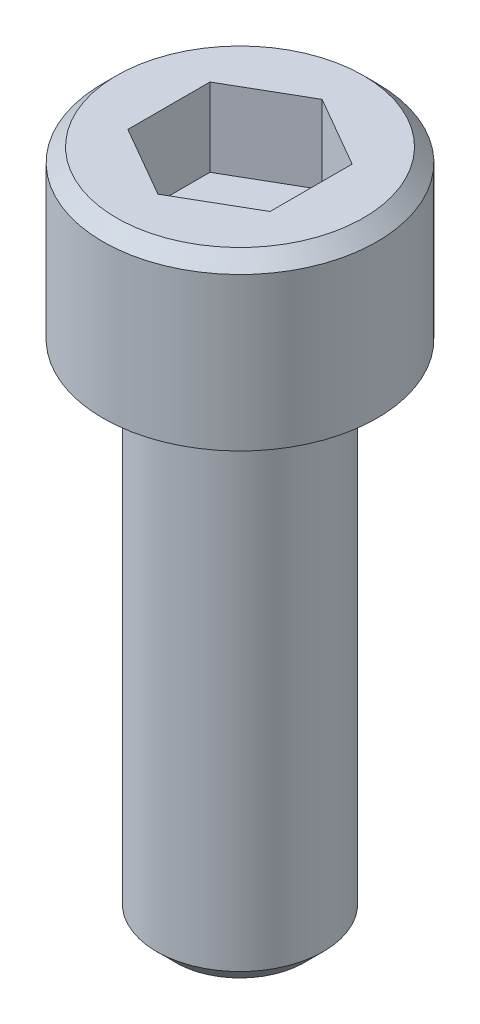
from build123d import *

# Parameters (mm, degrees)
CUT_EXTRUDE1_DEPTH = 1.9558


with BuildPart() as part:
    # Sketch1 → Base-Revolve (revolve)
    with BuildSketch(Plane.XY, mode=Mode.PRIVATE) as base_revolve_sk:
        Polygon((0, 0), (3.429, 0), (3.429, 3.8227), (3.0861, 4.1656), (0, 4.1656), align=None)
    revolve(base_revolve_sk.sketch.rotate(Axis((0, 0, 0), (0, 1, 0)), 90), axis=Axis((0, 0, 0), (0, 1, 0)))

    # Sketch2 → Boss-Revolve1 (revolve)
    with BuildSketch(Plane.XY, mode=Mode.PRIVATE) as boss_revolve1_sk:
        Polygon((0, -12.7), (1.61036, -12.7), (2.0828, -12.22756), (2.0828, 0), (0, 0), align=None)
    revolve(boss_revolve1_sk.sketch.rotate(Axis((0, 0, 0), (0, 1, 0)), 90), axis=Axis((0, 0, 0), (0, 1, 0)))

    # Sketch3 → Cut-Extrude1 (cut)
    with BuildSketch(Plane(origin=(0, 4.1656, 0), x_dir=(-1, 0, 0), z_dir=(0, 1, 0))):
        Polygon((1.778, 1.026528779), (0, 2.053057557), (-1.778, 1.026528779), (-1.778, -1.026528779), (0, -2.053057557), (1.778, -1.026528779), align=None)
    extrude(amount=-CUT_EXTRUDE1_DEPTH, mode=Mode.SUBTRACT)


solid = part.part
